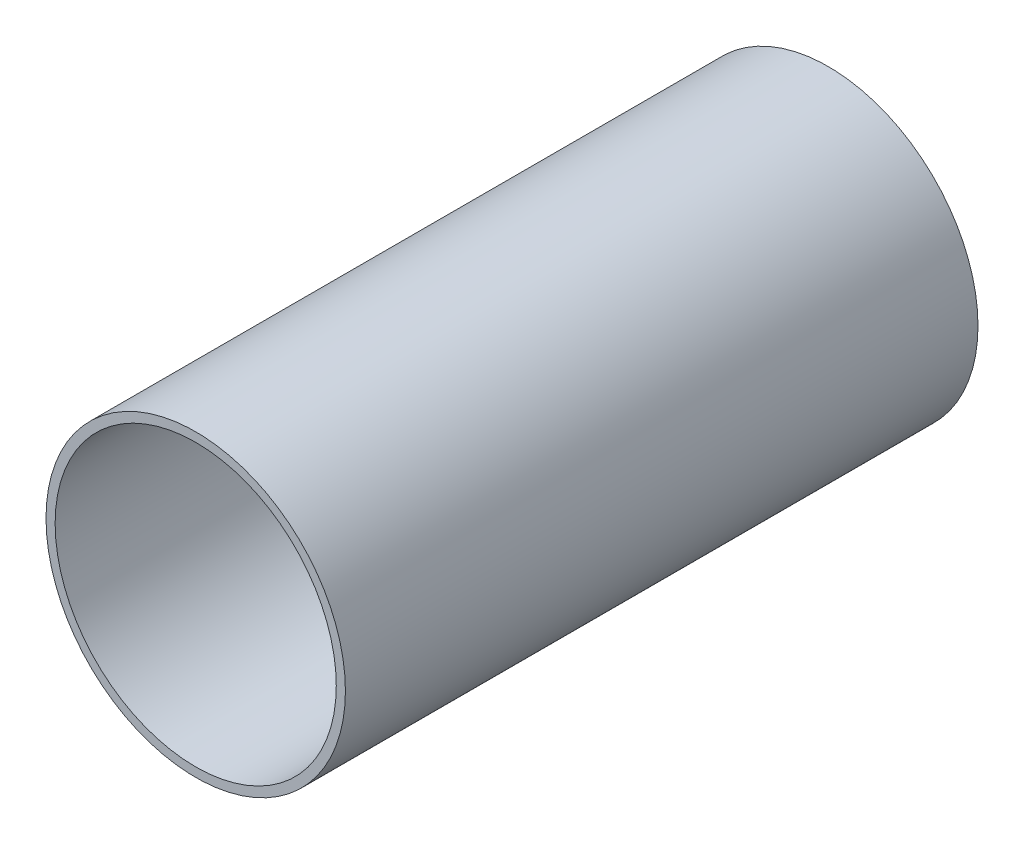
ISO-10303-21;
HEADER;
FILE_DESCRIPTION(('STEP AP214'),'2;1');
FILE_NAME('part.step','',(''),(''),'','','');
FILE_SCHEMA(('AUTOMOTIVE_DESIGN { 1 0 10303 214 1 1 1 1 }'));
ENDSEC;
DATA;
#1=APPLICATION_CONTEXT('core data for automotive mechanical design processes');
#2=APPLICATION_PROTOCOL_DEFINITION('international standard','automotive_design',2000,#1);
#3=PRODUCT_CONTEXT('',#1,'mechanical');
#4=PRODUCT('Part','Part','',(#3));
#5=PRODUCT_RELATED_PRODUCT_CATEGORY('part','',(#4));
#6=PRODUCT_DEFINITION_FORMATION('','',#4);
#7=PRODUCT_DEFINITION_CONTEXT('part definition',#1,'design');
#8=PRODUCT_DEFINITION('design','',#6,#7);
#9=PRODUCT_DEFINITION_SHAPE('','',#8);
#10=(LENGTH_UNIT() NAMED_UNIT(*) SI_UNIT(.MILLI.,.METRE.));
#11=(NAMED_UNIT(*) PLANE_ANGLE_UNIT() SI_UNIT($,.RADIAN.));
#12=(NAMED_UNIT(*) SI_UNIT($,.STERADIAN.) SOLID_ANGLE_UNIT());
#13=UNCERTAINTY_MEASURE_WITH_UNIT(LENGTH_MEASURE(1.E-05),#10,'distance_accuracy_value','');
#14=(GEOMETRIC_REPRESENTATION_CONTEXT(3) GLOBAL_UNCERTAINTY_ASSIGNED_CONTEXT((#13)) GLOBAL_UNIT_ASSIGNED_CONTEXT((#10,
#11,#12)) REPRESENTATION_CONTEXT('',''));
#15=CARTESIAN_POINT('',(0.,0.,0.));
#16=DIRECTION('',(0.,0.,1.));
#17=DIRECTION('',(1.,0.,0.));
#18=AXIS2_PLACEMENT_3D('',#15,#16,#17);
#19=CARTESIAN_POINT('',(0.,0.,114.3));
#20=DIRECTION('',(0.,0.,1.));
#21=DIRECTION('',(1.,0.,0.));
#22=AXIS2_PLACEMENT_3D('',#19,#20,#21);
#23=PLANE('',#22);
#24=CARTESIAN_POINT('',(0.,0.,114.3));
#25=DIRECTION('',(0.,0.,1.));
#26=DIRECTION('',(1.,0.,0.));
#27=AXIS2_PLACEMENT_3D('',#24,#25,#26);
#28=CIRCLE('',#27,27.051);
#29=CARTESIAN_POINT('',(27.051,0.,114.3));
#30=VERTEX_POINT('',#29);
#31=EDGE_CURVE('E10',#30,#30,#28,.T.);
#32=ORIENTED_EDGE('',*,*,#31,.T.);
#33=EDGE_LOOP('',(#32));
#34=FACE_BOUND('',#33,.T.);
#35=CARTESIAN_POINT('',(0.,0.,114.3));
#36=DIRECTION('',(0.,0.,1.));
#37=DIRECTION('',(1.,0.,0.));
#38=AXIS2_PLACEMENT_3D('',#35,#36,#37);
#39=CIRCLE('',#38,25.4);
#40=CARTESIAN_POINT('',(25.4,0.,114.3));
#41=VERTEX_POINT('',#40);
#42=EDGE_CURVE('E39',#41,#41,#39,.T.);
#43=ORIENTED_EDGE('',*,*,#42,.F.);
#44=EDGE_LOOP('',(#43));
#45=FACE_BOUND('',#44,.T.);
#46=ADVANCED_FACE('F28',(#34,#45),#23,.T.);
#47=CARTESIAN_POINT('',(0.,0.,0.));
#48=DIRECTION('',(0.,0.,1.));
#49=DIRECTION('',(1.,0.,0.));
#50=AXIS2_PLACEMENT_3D('',#47,#48,#49);
#51=PLANE('',#50);
#52=CARTESIAN_POINT('',(0.,0.,0.));
#53=DIRECTION('',(0.,0.,1.));
#54=DIRECTION('',(1.,0.,0.));
#55=AXIS2_PLACEMENT_3D('',#52,#53,#54);
#56=CIRCLE('',#55,27.051);
#57=CARTESIAN_POINT('',(27.051,0.,0.));
#58=VERTEX_POINT('',#57);
#59=EDGE_CURVE('E35',#58,#58,#56,.T.);
#60=ORIENTED_EDGE('',*,*,#59,.F.);
#61=EDGE_LOOP('',(#60));
#62=FACE_BOUND('',#61,.T.);
#63=CARTESIAN_POINT('',(0.,0.,0.));
#64=DIRECTION('',(0.,0.,1.));
#65=DIRECTION('',(1.,0.,0.));
#66=AXIS2_PLACEMENT_3D('',#63,#64,#65);
#67=CIRCLE('',#66,25.4);
#68=CARTESIAN_POINT('',(25.4,0.,0.));
#69=VERTEX_POINT('',#68);
#70=EDGE_CURVE('E43',#69,#69,#67,.T.);
#71=ORIENTED_EDGE('',*,*,#70,.T.);
#72=EDGE_LOOP('',(#71));
#73=FACE_BOUND('',#72,.T.);
#74=ADVANCED_FACE('F49',(#62,#73),#51,.F.);
#75=CARTESIAN_POINT('',(0.,0.,114.3));
#76=DIRECTION('',(0.,0.,-1.));
#77=DIRECTION('',(-1.,0.,0.));
#78=AXIS2_PLACEMENT_3D('',#75,#76,#77);
#79=CYLINDRICAL_SURFACE('',#78,27.051);
#80=ORIENTED_EDGE('',*,*,#31,.F.);
#81=EDGE_LOOP('',(#80));
#82=FACE_BOUND('',#81,.T.);
#83=ORIENTED_EDGE('',*,*,#59,.T.);
#84=EDGE_LOOP('',(#83));
#85=FACE_BOUND('',#84,.T.);
#86=ADVANCED_FACE('F30',(#82,#85),#79,.T.);
#87=CARTESIAN_POINT('',(0.,0.,114.3));
#88=DIRECTION('',(0.,0.,-1.));
#89=DIRECTION('',(-1.,0.,0.));
#90=AXIS2_PLACEMENT_3D('',#87,#88,#89);
#91=CYLINDRICAL_SURFACE('',#90,25.4);
#92=ORIENTED_EDGE('',*,*,#42,.T.);
#93=EDGE_LOOP('',(#92));
#94=FACE_BOUND('',#93,.T.);
#95=ORIENTED_EDGE('',*,*,#70,.F.);
#96=EDGE_LOOP('',(#95));
#97=FACE_BOUND('',#96,.T.);
#98=ADVANCED_FACE('F51',(#94,#97),#91,.F.);
#99=CLOSED_SHELL('',(#46,#74,#86,#98));
#100=MANIFOLD_SOLID_BREP('B2',#99);
#101=ADVANCED_BREP_SHAPE_REPRESENTATION('',(#18,#100),#14);
#102=SHAPE_DEFINITION_REPRESENTATION(#9,#101);
ENDSEC;
END-ISO-10303-21;
